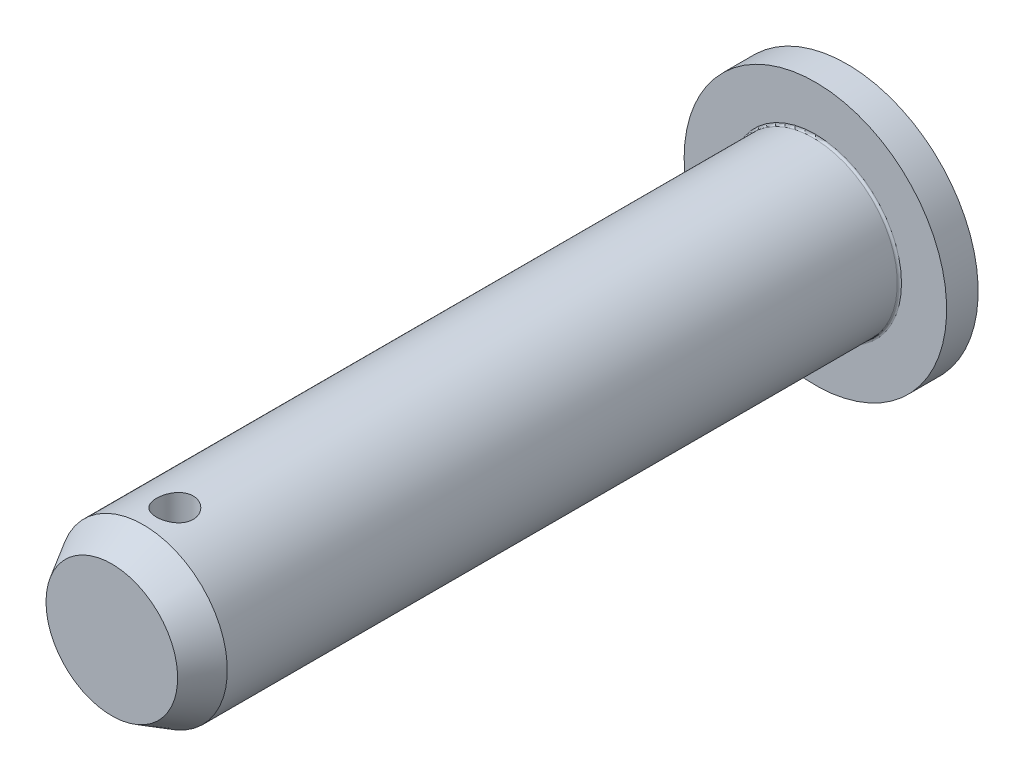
ISO-10303-21;
HEADER;
FILE_DESCRIPTION(('STEP AP214'),'2;1');
FILE_NAME('part.step','',(''),(''),'','','');
FILE_SCHEMA(('AUTOMOTIVE_DESIGN { 1 0 10303 214 1 1 1 1 }'));
ENDSEC;
DATA;
#1=APPLICATION_CONTEXT('core data for automotive mechanical design processes');
#2=APPLICATION_PROTOCOL_DEFINITION('international standard','automotive_design',2000,#1);
#3=PRODUCT_CONTEXT('',#1,'mechanical');
#4=PRODUCT('Part','Part','',(#3));
#5=PRODUCT_RELATED_PRODUCT_CATEGORY('part','',(#4));
#6=PRODUCT_DEFINITION_FORMATION('','',#4);
#7=PRODUCT_DEFINITION_CONTEXT('part definition',#1,'design');
#8=PRODUCT_DEFINITION('design','',#6,#7);
#9=PRODUCT_DEFINITION_SHAPE('','',#8);
#10=(LENGTH_UNIT() NAMED_UNIT(*) SI_UNIT(.MILLI.,.METRE.));
#11=(NAMED_UNIT(*) PLANE_ANGLE_UNIT() SI_UNIT($,.RADIAN.));
#12=(NAMED_UNIT(*) SI_UNIT($,.STERADIAN.) SOLID_ANGLE_UNIT());
#13=UNCERTAINTY_MEASURE_WITH_UNIT(LENGTH_MEASURE(1.E-05),#10,'distance_accuracy_value','');
#14=(GEOMETRIC_REPRESENTATION_CONTEXT(3) GLOBAL_UNCERTAINTY_ASSIGNED_CONTEXT((#13)) GLOBAL_UNIT_ASSIGNED_CONTEXT((#10,
#11,#12)) REPRESENTATION_CONTEXT('',''));
#15=CARTESIAN_POINT('',(0.,0.,0.));
#16=DIRECTION('',(0.,0.,1.));
#17=DIRECTION('',(1.,0.,0.));
#18=AXIS2_PLACEMENT_3D('',#15,#16,#17);
#19=CARTESIAN_POINT('',(0.,0.,0.));
#20=DIRECTION('',(0.,0.,1.));
#21=DIRECTION('',(1.,0.,0.));
#22=AXIS2_PLACEMENT_3D('',#19,#20,#21);
#23=PLANE('',#22);
#24=CARTESIAN_POINT('',(0.,0.,0.));
#25=DIRECTION('',(0.,0.,-1.));
#26=DIRECTION('',(-1.,0.,0.));
#27=AXIS2_PLACEMENT_3D('',#24,#25,#26);
#28=CIRCLE('',#27,12.5);
#29=CARTESIAN_POINT('',(-12.5,0.,0.));
#30=VERTEX_POINT('',#29);
#31=EDGE_CURVE('E173',#30,#30,#28,.F.);
#32=ORIENTED_EDGE('',*,*,#31,.F.);
#33=EDGE_LOOP('',(#32));
#34=FACE_BOUND('',#33,.T.);
#35=ADVANCED_FACE('F16',(#34),#23,.F.);
#36=CARTESIAN_POINT('',(0.,0.,3.));
#37=DIRECTION('',(0.,0.,-1.));
#38=DIRECTION('',(-1.,0.,0.));
#39=AXIS2_PLACEMENT_3D('',#36,#37,#38);
#40=CYLINDRICAL_SURFACE('',#39,12.5);
#41=ORIENTED_EDGE('',*,*,#31,.T.);
#42=EDGE_LOOP('',(#41));
#43=FACE_BOUND('',#42,.T.);
#44=CARTESIAN_POINT('',(0.,0.,3.));
#45=DIRECTION('',(0.,0.,-1.));
#46=DIRECTION('',(-1.,0.,0.));
#47=AXIS2_PLACEMENT_3D('',#44,#45,#46);
#48=CIRCLE('',#47,12.5);
#49=CARTESIAN_POINT('',(-12.5,0.,3.));
#50=VERTEX_POINT('',#49);
#51=EDGE_CURVE('E41',#50,#50,#48,.T.);
#52=ORIENTED_EDGE('',*,*,#51,.T.);
#53=EDGE_LOOP('',(#52));
#54=FACE_BOUND('',#53,.T.);
#55=ADVANCED_FACE('F109',(#43,#54),#40,.T.);
#56=CARTESIAN_POINT('',(0.,0.,70.));
#57=DIRECTION('',(0.,0.,1.));
#58=DIRECTION('',(1.,0.,0.));
#59=AXIS2_PLACEMENT_3D('',#56,#57,#58);
#60=PLANE('',#59);
#61=CARTESIAN_POINT('',(0.,0.,69.9999999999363));
#62=DIRECTION('',(0.,0.,-1.));
#63=DIRECTION('',(-1.,0.,0.));
#64=AXIS2_PLACEMENT_3D('',#61,#62,#63);
#65=CIRCLE('',#64,6.26794919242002);
#66=CARTESIAN_POINT('',(-6.26794919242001,0.,69.9999999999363));
#67=VERTEX_POINT('',#66);
#68=EDGE_CURVE('E40',#67,#67,#65,.T.);
#69=ORIENTED_EDGE('',*,*,#68,.F.);
#70=EDGE_LOOP('',(#69));
#71=FACE_BOUND('',#70,.T.);
#72=ADVANCED_FACE('F98',(#71),#60,.T.);
#73=CARTESIAN_POINT('',(0.,0.,3.));
#74=DIRECTION('',(0.,0.,-1.));
#75=DIRECTION('',(-1.,0.,0.));
#76=AXIS2_PLACEMENT_3D('',#73,#74,#75);
#77=PLANE('',#76);
#78=ORIENTED_EDGE('',*,*,#51,.F.);
#79=EDGE_LOOP('',(#78));
#80=FACE_BOUND('',#79,.T.);
#81=CARTESIAN_POINT('',(0.,0.,2.99999999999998));
#82=DIRECTION('',(0.,0.,1.));
#83=DIRECTION('',(-1.,0.,0.));
#84=AXIS2_PLACEMENT_3D('',#81,#82,#83);
#85=CIRCLE('',#84,8.20000000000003);
#86=CARTESIAN_POINT('',(8.2,0.,3.));
#87=VERTEX_POINT('',#86);
#88=CARTESIAN_POINT('',(-8.20000000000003,0.,3.));
#89=VERTEX_POINT('',#88);
#90=EDGE_CURVE('E36',#87,#89,#85,.F.);
#91=ORIENTED_EDGE('',*,*,#90,.T.);
#92=CARTESIAN_POINT('',(0.,0.,2.99999999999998));
#93=DIRECTION('',(0.,0.,1.));
#94=DIRECTION('',(1.,0.,0.));
#95=AXIS2_PLACEMENT_3D('',#92,#93,#94);
#96=CIRCLE('',#95,8.20000000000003);
#97=EDGE_CURVE('E33',#89,#87,#96,.F.);
#98=ORIENTED_EDGE('',*,*,#97,.T.);
#99=EDGE_LOOP('',(#91,#98));
#100=FACE_BOUND('',#99,.T.);
#101=ADVANCED_FACE('F38',(#80,#100),#77,.F.);
#102=CARTESIAN_POINT('',(0.,-8.00000000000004,64.));
#103=DIRECTION('',(0.,1.,0.));
#104=DIRECTION('',(0.,0.,1.));
#105=AXIS2_PLACEMENT_3D('',#102,#103,#104);
#106=CYLINDRICAL_SURFACE('',#105,1.75);
#107=CARTESIAN_POINT('',(0.,-8.00000000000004,62.25));
#108=CARTESIAN_POINT('',(-0.0969542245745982,-7.99999751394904,62.2500047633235));
#109=CARTESIAN_POINT('',(-0.194026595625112,-7.99821775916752,62.2580922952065));
#110=CARTESIAN_POINT('',(-0.385494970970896,-7.99128363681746,62.2902190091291));
#111=CARTESIAN_POINT('',(-0.479885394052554,-7.98612270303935,62.3142892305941));
#112=CARTESIAN_POINT('',(-0.663074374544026,-7.97300142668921,62.3775930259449));
#113=CARTESIAN_POINT('',(-0.751881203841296,-7.96504534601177,62.4168035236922));
#114=CARTESIAN_POINT('',(-0.921624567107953,-7.94719454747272,62.5092123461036));
#115=CARTESIAN_POINT('',(-1.00256349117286,-7.93730042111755,62.5624064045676));
#116=CARTESIAN_POINT('',(-1.15561684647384,-7.91647701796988,62.6821880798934));
#117=CARTESIAN_POINT('',(-1.22758632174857,-7.90553481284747,62.7489587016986));
#118=CARTESIAN_POINT('',(-1.35940230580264,-7.88393920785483,62.8936084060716));
#119=CARTESIAN_POINT('',(-1.41924707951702,-7.87328584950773,62.971489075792));
#120=CARTESIAN_POINT('',(-1.52574375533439,-7.85334855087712,63.1372071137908));
#121=CARTESIAN_POINT('',(-1.57224281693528,-7.84408101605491,63.225144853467));
#122=CARTESIAN_POINT('',(-1.64974715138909,-7.8281485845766,63.4078216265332));
#123=CARTESIAN_POINT('',(-1.68075440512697,-7.82148335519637,63.5025597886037));
#124=CARTESIAN_POINT('',(-1.72592018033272,-7.81164071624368,63.6945886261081));
#125=CARTESIAN_POINT('',(-1.74033334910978,-7.80841065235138,63.7918166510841));
#126=CARTESIAN_POINT('',(-1.75269359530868,-7.80564592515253,63.9873604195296));
#127=CARTESIAN_POINT('',(-1.75064267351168,-7.80611081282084,64.0856760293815));
#128=CARTESIAN_POINT('',(-1.73033792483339,-7.81063578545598,64.2787099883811));
#129=CARTESIAN_POINT('',(-1.7123800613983,-7.81463019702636,64.3734612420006));
#130=CARTESIAN_POINT('',(-1.66123985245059,-7.82566035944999,64.5585734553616));
#131=CARTESIAN_POINT('',(-1.62805654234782,-7.83269630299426,64.6489341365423));
#132=CARTESIAN_POINT('',(-1.54713447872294,-7.84908171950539,64.82353405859));
#133=CARTESIAN_POINT('',(-1.49928149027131,-7.85844923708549,64.907718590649));
#134=CARTESIAN_POINT('',(-1.39046237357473,-7.87843039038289,65.0669662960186));
#135=CARTESIAN_POINT('',(-1.3294953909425,-7.8890441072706,65.1420288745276));
#136=CARTESIAN_POINT('',(-1.19462394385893,-7.9106021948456,65.2826001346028));
#137=CARTESIAN_POINT('',(-1.1204699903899,-7.92154877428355,65.3478693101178));
#138=CARTESIAN_POINT('',(-0.962109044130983,-7.94233676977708,65.4651121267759));
#139=CARTESIAN_POINT('',(-0.877897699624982,-7.95217770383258,65.5170799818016));
#140=CARTESIAN_POINT('',(-0.701496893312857,-7.96967874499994,65.6063016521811));
#141=CARTESIAN_POINT('',(-0.609284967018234,-7.97733243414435,65.6435122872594));
#142=CARTESIAN_POINT('',(-0.419828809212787,-7.98953717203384,65.7017717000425));
#143=CARTESIAN_POINT('',(-0.32259557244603,-7.99409471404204,65.722854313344));
#144=CARTESIAN_POINT('',(-0.187167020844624,-7.99789771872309,65.7403681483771));
#145=CARTESIAN_POINT('',(-0.149834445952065,-7.99868424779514,65.743976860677));
#146=CARTESIAN_POINT('',(-0.0750071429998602,-7.99973586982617,65.7487937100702));
#147=CARTESIAN_POINT('',(-0.0375124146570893,-8.00000096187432,65.7500018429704));
#148=CARTESIAN_POINT('',(0.0969542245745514,-7.99999751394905,65.7499952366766));
#149=CARTESIAN_POINT('',(0.194026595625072,-7.99821775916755,65.7419077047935));
#150=CARTESIAN_POINT('',(0.385494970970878,-7.99128363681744,65.7097809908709));
#151=CARTESIAN_POINT('',(0.47988539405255,-7.98612270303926,65.6857107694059));
#152=CARTESIAN_POINT('',(0.663074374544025,-7.97300142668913,65.6224069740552));
#153=CARTESIAN_POINT('',(0.751881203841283,-7.96504534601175,65.5831964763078));
#154=CARTESIAN_POINT('',(0.921624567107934,-7.94719454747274,65.4907876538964));
#155=CARTESIAN_POINT('',(1.00256349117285,-7.93730042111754,65.4375935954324));
#156=CARTESIAN_POINT('',(1.15561684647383,-7.91647701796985,65.3178119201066));
#157=CARTESIAN_POINT('',(1.22758632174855,-7.90553481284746,65.2510412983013));
#158=CARTESIAN_POINT('',(1.35940230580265,-7.88393920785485,65.1063915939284));
#159=CARTESIAN_POINT('',(1.41924707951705,-7.87328584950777,65.028510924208));
#160=CARTESIAN_POINT('',(1.52574375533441,-7.85334855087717,64.8627928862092));
#161=CARTESIAN_POINT('',(1.57224281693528,-7.84408101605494,64.774855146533));
#162=CARTESIAN_POINT('',(1.64974715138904,-7.82814858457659,64.5921783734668));
#163=CARTESIAN_POINT('',(1.68075440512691,-7.82148335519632,64.4974402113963));
#164=CARTESIAN_POINT('',(1.72592018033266,-7.81164071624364,64.3054113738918));
#165=CARTESIAN_POINT('',(1.74033334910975,-7.80841065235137,64.2081833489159));
#166=CARTESIAN_POINT('',(1.75269359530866,-7.80564592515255,64.0126395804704));
#167=CARTESIAN_POINT('',(1.75064267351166,-7.80611081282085,63.9143239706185));
#168=CARTESIAN_POINT('',(1.73033792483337,-7.81063578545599,63.7212900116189));
#169=CARTESIAN_POINT('',(1.71238006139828,-7.81463019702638,63.6265387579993));
#170=CARTESIAN_POINT('',(1.66123985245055,-7.82566035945,63.4414265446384));
#171=CARTESIAN_POINT('',(1.62805654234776,-7.83269630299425,63.3510658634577));
#172=CARTESIAN_POINT('',(1.54713447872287,-7.84908171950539,63.1764659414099));
#173=CARTESIAN_POINT('',(1.49928149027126,-7.85844923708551,63.0922814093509));
#174=CARTESIAN_POINT('',(1.39046237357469,-7.8784303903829,62.9330337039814));
#175=CARTESIAN_POINT('',(1.32949539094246,-7.88904410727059,62.8579711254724));
#176=CARTESIAN_POINT('',(1.19462394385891,-7.9106021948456,62.7173998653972));
#177=CARTESIAN_POINT('',(1.12046999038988,-7.92154877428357,62.6521306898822));
#178=CARTESIAN_POINT('',(0.962109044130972,-7.94233676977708,62.5348878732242));
#179=CARTESIAN_POINT('',(0.877897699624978,-7.95217770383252,62.4829200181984));
#180=CARTESIAN_POINT('',(0.701496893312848,-7.96967874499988,62.3936983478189));
#181=CARTESIAN_POINT('',(0.609284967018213,-7.97733243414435,62.3564877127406));
#182=CARTESIAN_POINT('',(0.419828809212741,-7.98953717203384,62.2982282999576));
#183=CARTESIAN_POINT('',(0.322595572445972,-7.99409471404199,62.277145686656));
#184=CARTESIAN_POINT('',(0.187167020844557,-7.99789771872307,62.2596318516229));
#185=CARTESIAN_POINT('',(0.149834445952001,-7.99868424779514,62.256023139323));
#186=CARTESIAN_POINT('',(0.0750071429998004,-7.99973586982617,62.2512062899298));
#187=CARTESIAN_POINT('',(0.0375124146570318,-8.00000096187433,62.2499981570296));
#188=CARTESIAN_POINT('',(0.,-8.00000000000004,62.25));
#189=B_SPLINE_CURVE_WITH_KNOTS('',3,(#107,#108,#109,#110,#111,#112,#113,#114,#115,#116,#117,
#118,#119,#120,#121,#122,#123,#124,#125,#126,#127,#128,#129,#130,#131,#132,#133,#134,#135,#136,
#137,#138,#139,#140,#141,#142,#143,#144,#145,#146,#147,#148,#149,#150,#151,#152,#153,#154,#155,
#156,#157,#158,#159,#160,#161,#162,#163,#164,#165,#166,#167,#168,#169,#170,#171,#172,#173,#174,
#175,#176,#177,#178,#179,#180,#181,#182,#183,#184,#185,#186,#187,#188),.UNSPECIFIED.,.T.,.F.,(4,
2,2,2,2,2,2,2,2,2,2,2,2,2,2,2,2,2,2,2,2,2,2,2,2,2,2,2,2,2,2,2,2,2,2,2,2,2,2,2,4),(0.,
0.290719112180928,0.582004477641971,0.872847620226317,1.16360213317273,1.45857215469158,
1.75358435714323,2.05185140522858,2.35008030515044,2.64366898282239,2.93722198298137,
3.22542526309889,3.5136468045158,3.8041723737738,4.09471687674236,4.39149443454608,
4.68840087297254,4.98616977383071,5.28331224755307,5.39579374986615,5.50827544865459,
5.79899456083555,6.09027992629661,6.38112306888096,6.67187758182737,6.96684760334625,
7.26185980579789,7.56012685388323,7.85835575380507,8.15194443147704,8.445497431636,
8.73370071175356,9.0219222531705,9.31244782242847,9.60299232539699,9.8997698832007,
10.1966763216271,10.4944452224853,10.7915876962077,10.9040691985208,11.0165508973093),.UNSPECIFIED.);
#190=CARTESIAN_POINT('',(0.,-8.00000000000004,62.25));
#191=VERTEX_POINT('',#190);
#192=EDGE_CURVE('E47',#191,#191,#189,.T.);
#193=ORIENTED_EDGE('',*,*,#192,.F.);
#194=EDGE_LOOP('',(#193));
#195=FACE_BOUND('',#194,.T.);
#196=CARTESIAN_POINT('',(0.,7.99999999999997,65.7500000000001));
#197=CARTESIAN_POINT('',(-0.0969542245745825,7.99999751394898,65.7499952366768));
#198=CARTESIAN_POINT('',(-0.194026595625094,7.99821775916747,65.7419077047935));
#199=CARTESIAN_POINT('',(-0.385494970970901,7.9912836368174,65.7097809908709));
#200=CARTESIAN_POINT('',(-0.479885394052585,7.98612270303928,65.685710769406));
#201=CARTESIAN_POINT('',(-0.663074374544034,7.97300142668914,65.6224069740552));
#202=CARTESIAN_POINT('',(-0.751881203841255,7.96504534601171,65.5831964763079));
#203=CARTESIAN_POINT('',(-0.921624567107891,7.94719454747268,65.4907876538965));
#204=CARTESIAN_POINT('',(-1.00256349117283,7.93730042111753,65.4375935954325));
#205=CARTESIAN_POINT('',(-1.1556168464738,7.91647701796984,65.3178119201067));
#206=CARTESIAN_POINT('',(-1.22758632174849,7.90553481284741,65.2510412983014));
#207=CARTESIAN_POINT('',(-1.35940230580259,7.8839392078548,65.1063915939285));
#208=CARTESIAN_POINT('',(-1.41924707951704,7.87328584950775,65.0285109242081));
#209=CARTESIAN_POINT('',(-1.52574375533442,7.85334855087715,64.8627928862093));
#210=CARTESIAN_POINT('',(-1.57224281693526,7.84408101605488,64.7748551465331));
#211=CARTESIAN_POINT('',(-1.64974715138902,7.82814858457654,64.5921783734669));
#212=CARTESIAN_POINT('',(-1.6807544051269,7.82148335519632,64.4974402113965));
#213=CARTESIAN_POINT('',(-1.72592018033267,7.81164071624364,64.305411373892));
#214=CARTESIAN_POINT('',(-1.74033334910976,7.80841065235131,64.208183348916));
#215=CARTESIAN_POINT('',(-1.75269359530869,7.80564592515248,64.0126395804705));
#216=CARTESIAN_POINT('',(-1.75064267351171,7.80611081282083,63.9143239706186));
#217=CARTESIAN_POINT('',(-1.73033792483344,7.81063578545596,63.721290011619));
#218=CARTESIAN_POINT('',(-1.71238006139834,7.8146301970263,63.6265387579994));
#219=CARTESIAN_POINT('',(-1.6612398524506,7.82566035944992,63.4414265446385));
#220=CARTESIAN_POINT('',(-1.62805654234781,7.83269630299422,63.3510658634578));
#221=CARTESIAN_POINT('',(-1.54713447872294,7.84908171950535,63.17646594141));
#222=CARTESIAN_POINT('',(-1.49928149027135,7.85844923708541,63.092281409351));
#223=CARTESIAN_POINT('',(-1.39046237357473,7.87843039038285,62.9330337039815));
#224=CARTESIAN_POINT('',(-1.32949539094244,7.88904410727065,62.8579711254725));
#225=CARTESIAN_POINT('',(-1.19462394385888,7.91060219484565,62.7173998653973));
#226=CARTESIAN_POINT('',(-1.12046999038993,7.92154877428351,62.6521306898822));
#227=CARTESIAN_POINT('',(-0.962109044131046,7.942336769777,62.5348878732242));
#228=CARTESIAN_POINT('',(-0.877897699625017,7.95217770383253,62.4829200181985));
#229=CARTESIAN_POINT('',(-0.701496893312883,7.9696787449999,62.393698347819));
#230=CARTESIAN_POINT('',(-0.609284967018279,7.97733243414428,62.3564877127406));
#231=CARTESIAN_POINT('',(-0.419828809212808,7.98953717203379,62.2982282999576));
#232=CARTESIAN_POINT('',(-0.322595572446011,7.99409471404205,62.2771456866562));
#233=CARTESIAN_POINT('',(-0.187167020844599,7.99789771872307,62.259631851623));
#234=CARTESIAN_POINT('',(-0.149834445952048,7.9986842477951,62.256023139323));
#235=CARTESIAN_POINT('',(-0.0750071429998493,7.9997358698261,62.2512062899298));
#236=CARTESIAN_POINT('',(-0.0375124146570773,8.00000096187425,62.2499981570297));
#237=CARTESIAN_POINT('',(0.0969542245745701,7.99999751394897,62.2500047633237));
#238=CARTESIAN_POINT('',(0.1940265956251,7.99821775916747,62.2580922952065));
#239=CARTESIAN_POINT('',(0.385494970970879,7.99128363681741,62.2902190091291));
#240=CARTESIAN_POINT('',(0.479885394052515,7.98612270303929,62.3142892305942));
#241=CARTESIAN_POINT('',(0.663074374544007,7.97300142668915,62.377593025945));
#242=CARTESIAN_POINT('',(0.751881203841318,7.9650453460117,62.4168035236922));
#243=CARTESIAN_POINT('',(0.921624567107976,7.94719454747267,62.5092123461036));
#244=CARTESIAN_POINT('',(1.00256349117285,7.93730042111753,62.5624064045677));
#245=CARTESIAN_POINT('',(1.15561684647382,7.91647701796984,62.6821880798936));
#246=CARTESIAN_POINT('',(1.2275863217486,7.9055348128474,62.7489587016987));
#247=CARTESIAN_POINT('',(1.35940230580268,7.88393920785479,62.8936084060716));
#248=CARTESIAN_POINT('',(1.41924707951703,7.87328584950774,62.9714890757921));
#249=CARTESIAN_POINT('',(1.52574375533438,7.85334855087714,63.1372071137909));
#250=CARTESIAN_POINT('',(1.5722428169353,7.84408101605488,63.2251448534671));
#251=CARTESIAN_POINT('',(1.64974715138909,7.82814858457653,63.4078216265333));
#252=CARTESIAN_POINT('',(1.68075440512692,7.82148335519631,63.5025597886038));
#253=CARTESIAN_POINT('',(1.72592018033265,7.81164071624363,63.6945886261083));
#254=CARTESIAN_POINT('',(1.74033334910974,7.80841065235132,63.7918166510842));
#255=CARTESIAN_POINT('',(1.75269359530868,7.80564592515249,63.9873604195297));
#256=CARTESIAN_POINT('',(1.75064267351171,7.80611081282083,64.0856760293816));
#257=CARTESIAN_POINT('',(1.73033792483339,7.81063578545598,64.2787099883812));
#258=CARTESIAN_POINT('',(1.71238006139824,7.81463019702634,64.3734612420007));
#259=CARTESIAN_POINT('',(1.66123985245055,7.82566035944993,64.5585734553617));
#260=CARTESIAN_POINT('',(1.62805654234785,7.83269630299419,64.6489341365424));
#261=CARTESIAN_POINT('',(1.54713447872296,7.84908171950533,64.8235340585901));
#262=CARTESIAN_POINT('',(1.49928149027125,7.85844923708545,64.9077185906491));
#263=CARTESIAN_POINT('',(1.39046237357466,7.87843039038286,65.0669662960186));
#264=CARTESIAN_POINT('',(1.32949539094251,7.88904410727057,65.1420288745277));
#265=CARTESIAN_POINT('',(1.19462394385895,7.91060219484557,65.2826001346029));
#266=CARTESIAN_POINT('',(1.12046999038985,7.92154877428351,65.3478693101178));
#267=CARTESIAN_POINT('',(0.96210904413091,7.94233676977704,65.4651121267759));
#268=CARTESIAN_POINT('',(0.877897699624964,7.95217770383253,65.5170799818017));
#269=CARTESIAN_POINT('',(0.701496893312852,7.96967874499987,65.6063016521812));
#270=CARTESIAN_POINT('',(0.609284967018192,7.97733243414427,65.6435122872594));
#271=CARTESIAN_POINT('',(0.419828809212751,7.98953717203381,65.7017717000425));
#272=CARTESIAN_POINT('',(0.32259557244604,7.99409471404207,65.7228543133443));
#273=CARTESIAN_POINT('',(0.187167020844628,7.99789771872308,65.7403681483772));
#274=CARTESIAN_POINT('',(0.149834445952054,7.9986842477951,65.743976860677));
#275=CARTESIAN_POINT('',(0.0750071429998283,7.9997358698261,65.7487937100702));
#276=CARTESIAN_POINT('',(0.0375124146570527,8.00000096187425,65.7500018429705));
#277=CARTESIAN_POINT('',(0.,7.99999999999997,65.7500000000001));
#278=B_SPLINE_CURVE_WITH_KNOTS('',3,(#196,#197,#198,#199,#200,#201,#202,#203,#204,#205,#206,
#207,#208,#209,#210,#211,#212,#213,#214,#215,#216,#217,#218,#219,#220,#221,#222,#223,#224,#225,
#226,#227,#228,#229,#230,#231,#232,#233,#234,#235,#236,#237,#238,#239,#240,#241,#242,#243,#244,
#245,#246,#247,#248,#249,#250,#251,#252,#253,#254,#255,#256,#257,#258,#259,#260,#261,#262,#263,
#264,#265,#266,#267,#268,#269,#270,#271,#272,#273,#274,#275,#276,#277),.UNSPECIFIED.,.T.,.F.,(4,
2,2,2,2,2,2,2,2,2,2,2,2,2,2,2,2,2,2,2,2,2,2,2,2,2,2,2,2,2,2,2,2,2,2,2,2,2,2,2,4),(0.,
0.290719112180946,0.582004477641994,0.872847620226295,1.16360213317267,1.45857215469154,
1.7535843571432,2.05185140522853,2.35008030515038,2.64366898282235,2.93722198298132,
3.2254252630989,3.51364680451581,3.80417237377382,4.09471687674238,4.39149443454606,
4.68840087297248,4.9861697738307,5.2833122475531,5.39579374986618,5.50827544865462,
5.79899456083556,6.09027992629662,6.38112306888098,6.67187758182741,6.96684760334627,
7.26185980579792,7.56012685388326,7.85835575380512,8.15194443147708,8.44549743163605,
8.73370071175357,9.02192225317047,9.31244782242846,9.60299232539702,9.89976988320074,
10.1966763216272,10.4944452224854,10.7915876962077,10.9040691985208,11.0165508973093),.UNSPECIFIED.);
#279=CARTESIAN_POINT('',(0.,7.99999999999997,65.7500000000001));
#280=VERTEX_POINT('',#279);
#281=EDGE_CURVE('E73',#280,#280,#278,.T.);
#282=ORIENTED_EDGE('',*,*,#281,.F.);
#283=EDGE_LOOP('',(#282));
#284=FACE_BOUND('',#283,.T.);
#285=ADVANCED_FACE('F90',(#195,#284),#106,.F.);
#286=CARTESIAN_POINT('',(0.,0.,66.9999999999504));
#287=DIRECTION('',(0.,0.,-1.));
#288=DIRECTION('',(-1.,0.,0.));
#289=AXIS2_PLACEMENT_3D('',#286,#287,#288);
#290=CONICAL_SURFACE('',#289,7.99999999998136,0.523598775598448);
#291=CARTESIAN_POINT('',(0.,0.,67.));
#292=DIRECTION('',(0.,0.,-1.));
#293=DIRECTION('',(-1.,0.,0.));
#294=AXIS2_PLACEMENT_3D('',#291,#292,#293);
#295=CIRCLE('',#294,8.);
#296=CARTESIAN_POINT('',(-8.,0.,67.));
#297=VERTEX_POINT('',#296);
#298=EDGE_CURVE('E26',#297,#297,#295,.T.);
#299=ORIENTED_EDGE('',*,*,#298,.F.);
#300=EDGE_LOOP('',(#299));
#301=FACE_BOUND('',#300,.T.);
#302=ORIENTED_EDGE('',*,*,#68,.T.);
#303=EDGE_LOOP('',(#302));
#304=FACE_BOUND('',#303,.T.);
#305=ADVANCED_FACE('F66',(#301,#304),#290,.T.);
#306=CARTESIAN_POINT('',(0.,0.,3.19999999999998));
#307=DIRECTION('',(0.,0.,-1.));
#308=DIRECTION('',(-1.,0.,0.));
#309=AXIS2_PLACEMENT_3D('',#306,#307,#308);
#310=TOROIDAL_SURFACE('',#309,8.20000000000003,0.2);
#311=ORIENTED_EDGE('',*,*,#97,.F.);
#312=ORIENTED_EDGE('',*,*,#90,.F.);
#313=EDGE_LOOP('',(#311,#312));
#314=FACE_BOUND('',#313,.T.);
#315=CARTESIAN_POINT('',(0.,0.,3.19999999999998));
#316=DIRECTION('',(0.,0.,-1.));
#317=DIRECTION('',(-1.,0.,0.));
#318=AXIS2_PLACEMENT_3D('',#315,#316,#317);
#319=CIRCLE('',#318,8.);
#320=CARTESIAN_POINT('',(-8.,0.,3.19999999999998));
#321=VERTEX_POINT('',#320);
#322=EDGE_CURVE('E11',#321,#321,#319,.F.);
#323=ORIENTED_EDGE('',*,*,#322,.F.);
#324=EDGE_LOOP('',(#323));
#325=FACE_BOUND('',#324,.T.);
#326=ADVANCED_FACE('F45',(#314,#325),#310,.F.);
#327=CARTESIAN_POINT('',(0.,0.,70.));
#328=DIRECTION('',(0.,0.,-1.));
#329=DIRECTION('',(-1.,0.,0.));
#330=AXIS2_PLACEMENT_3D('',#327,#328,#329);
#331=CYLINDRICAL_SURFACE('',#330,8.);
#332=ORIENTED_EDGE('',*,*,#322,.T.);
#333=EDGE_LOOP('',(#332));
#334=FACE_BOUND('',#333,.T.);
#335=ORIENTED_EDGE('',*,*,#298,.T.);
#336=EDGE_LOOP('',(#335));
#337=FACE_BOUND('',#336,.T.);
#338=ORIENTED_EDGE('',*,*,#281,.T.);
#339=EDGE_LOOP('',(#338));
#340=FACE_BOUND('',#339,.T.);
#341=ORIENTED_EDGE('',*,*,#192,.T.);
#342=EDGE_LOOP('',(#341));
#343=FACE_BOUND('',#342,.T.);
#344=ADVANCED_FACE('F65',(#334,#337,#340,#343),#331,.T.);
#345=CLOSED_SHELL('',(#35,#55,#72,#101,#285,#305,#326,#344));
#346=MANIFOLD_SOLID_BREP('B1',#345);
#347=ADVANCED_BREP_SHAPE_REPRESENTATION('',(#18,#346),#14);
#348=SHAPE_DEFINITION_REPRESENTATION(#9,#347);
ENDSEC;
END-ISO-10303-21;
